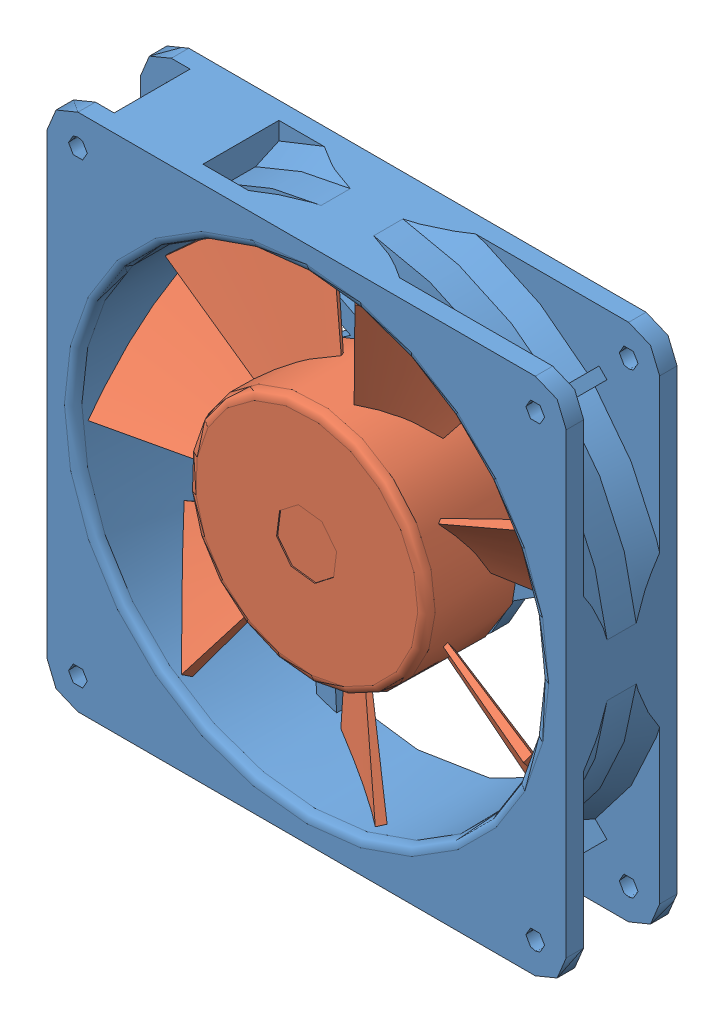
SolidWorks assembly Assem25.sldasm, configuration Default (file format 4700). Lengths in mm.
Overall size (127.76 127.76 25.4).
2 component instances, 2 part files, 2 mates.
Components (placement in the parent):
- Fan Housing-1: Fan Housing.sldprt [default] at (-3.0459 -8.1361 -5.5652) size (119 119 25.4)
- Fan-1: Fan.sldprt [default] at (-3.0459 -8.1361 -5.5652) x (0 0 -1) z (0.263975 -0.96453 0) size (21.4 104 104)
Mates (geometry in assembly coordinates):
- Coincident2: coincident anti-aligned: plane of Fan Housing-1 through (-3.0459 -8.1361 -1.5652) normal (0 0 1); plane of Fan-1 through (23.4786 -0.8768 -1.5652) normal (0 0 -1)
- Concentric1: concentric aligned: circle of Fan Housing-1; circle of Fan-1
